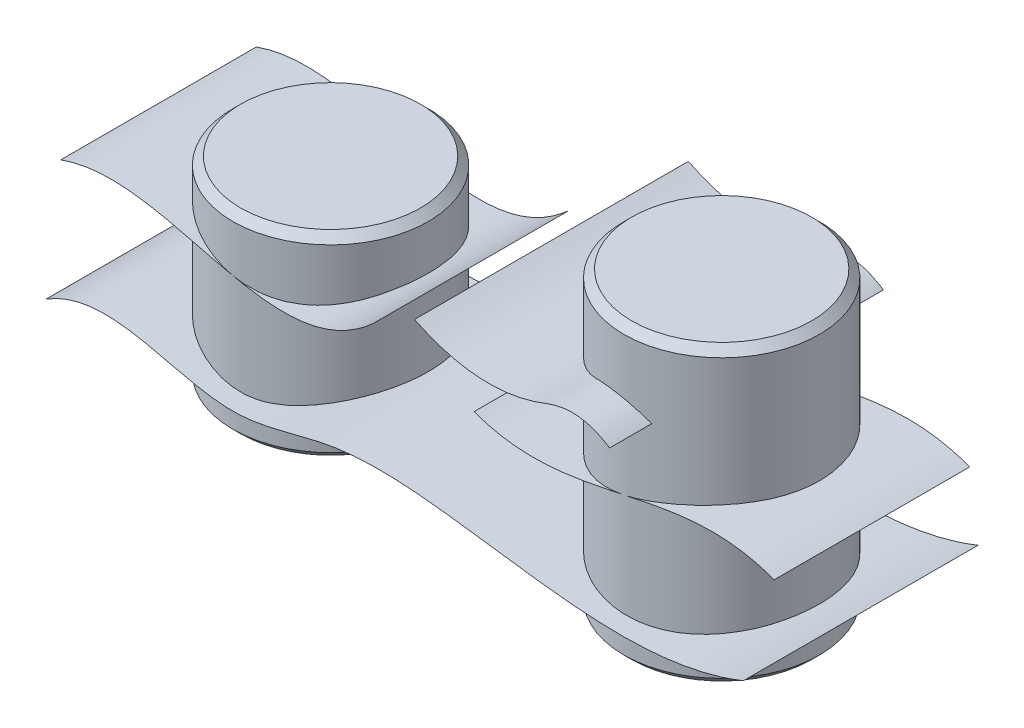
ISO-10303-21;
HEADER;
FILE_DESCRIPTION(('STEP AP214'),'2;1');
FILE_NAME('part.step','',(''),(''),'','','');
FILE_SCHEMA(('AUTOMOTIVE_DESIGN { 1 0 10303 214 1 1 1 1 }'));
ENDSEC;
DATA;
#1=APPLICATION_CONTEXT('core data for automotive mechanical design processes');
#2=APPLICATION_PROTOCOL_DEFINITION('international standard','automotive_design',2000,#1);
#3=PRODUCT_CONTEXT('',#1,'mechanical');
#4=PRODUCT('Part','Part','',(#3));
#5=PRODUCT_RELATED_PRODUCT_CATEGORY('part','',(#4));
#6=PRODUCT_DEFINITION_FORMATION('','',#4);
#7=PRODUCT_DEFINITION_CONTEXT('part definition',#1,'design');
#8=PRODUCT_DEFINITION('design','',#6,#7);
#9=PRODUCT_DEFINITION_SHAPE('','',#8);
#10=(LENGTH_UNIT() NAMED_UNIT(*) SI_UNIT(.MILLI.,.METRE.));
#11=(NAMED_UNIT(*) PLANE_ANGLE_UNIT() SI_UNIT($,.RADIAN.));
#12=(NAMED_UNIT(*) SI_UNIT($,.STERADIAN.) SOLID_ANGLE_UNIT());
#13=UNCERTAINTY_MEASURE_WITH_UNIT(LENGTH_MEASURE(1.E-05),#10,'distance_accuracy_value','');
#14=(GEOMETRIC_REPRESENTATION_CONTEXT(3) GLOBAL_UNCERTAINTY_ASSIGNED_CONTEXT((#13)) GLOBAL_UNIT_ASSIGNED_CONTEXT((#10,
#11,#12)) REPRESENTATION_CONTEXT('',''));
#15=CARTESIAN_POINT('',(0.,0.,0.));
#16=DIRECTION('',(0.,0.,1.));
#17=DIRECTION('',(1.,0.,0.));
#18=AXIS2_PLACEMENT_3D('',#15,#16,#17);
#19=CARTESIAN_POINT('',(61.6966040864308,36.7579614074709,-25.));
#20=CARTESIAN_POINT('',(87.2884607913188,27.2617068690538,-25.));
#21=CARTESIAN_POINT('',(112.376036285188,47.7539861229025,-25.));
#22=CARTESIAN_POINT('',(138.418377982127,37.8768206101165,-25.));
#23=B_SPLINE_CURVE_WITH_KNOTS('',3,(#19,#20,#21,#22),.UNSPECIFIED.,.F.,.F.,(4,4),(0.,1.),.UNSPECIFIED.);
#24=DIRECTION('',(0.,0.,1.));
#25=VECTOR('',#24,1.);
#26=SURFACE_OF_LINEAR_EXTRUSION('',#23,#25);
#27=CARTESIAN_POINT('',(61.6966040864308,36.7579614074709,25.));
#28=CARTESIAN_POINT('',(87.2884607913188,27.2617068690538,25.));
#29=CARTESIAN_POINT('',(112.376036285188,47.7539861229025,25.));
#30=CARTESIAN_POINT('',(138.418377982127,37.8768206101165,25.));
#31=B_SPLINE_CURVE_WITH_KNOTS('',3,(#27,#28,#29,#30),.UNSPECIFIED.,.F.,.F.,(4,4),(0.,1.),.UNSPECIFIED.);
#32=CARTESIAN_POINT('',(61.6966040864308,36.7579614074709,25.));
#33=VERTEX_POINT('',#32);
#34=CARTESIAN_POINT('',(138.418377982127,37.8768206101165,25.));
#35=VERTEX_POINT('',#34);
#36=EDGE_CURVE('E90',#33,#35,#31,.T.);
#37=ORIENTED_EDGE('',*,*,#36,.F.);
#38=DIRECTION('',(0.,0.,1.));
#39=VECTOR('',#38,1.);
#40=CARTESIAN_POINT('',(61.6966040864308,36.7579614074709,-25.));
#41=LINE('',#40,#39);
#42=CARTESIAN_POINT('',(61.6966040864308,36.7579614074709,-25.));
#43=VERTEX_POINT('',#42);
#44=EDGE_CURVE('E72',#43,#33,#41,.T.);
#45=ORIENTED_EDGE('',*,*,#44,.F.);
#46=CARTESIAN_POINT('',(138.418377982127,37.8768206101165,-25.));
#47=VERTEX_POINT('',#46);
#48=EDGE_CURVE('E78',#43,#47,#23,.T.);
#49=ORIENTED_EDGE('',*,*,#48,.T.);
#50=DIRECTION('',(0.,0.,1.));
#51=VECTOR('',#50,1.);
#52=CARTESIAN_POINT('',(138.418377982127,37.8768206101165,-25.));
#53=LINE('',#52,#51);
#54=EDGE_CURVE('E12',#47,#35,#53,.T.);
#55=ORIENTED_EDGE('',*,*,#54,.T.);
#56=EDGE_LOOP('',(#37,#45,#49,#55));
#57=FACE_BOUND('',#56,.T.);
#58=ADVANCED_FACE('F70',(#57),#26,.T.);
#59=OPEN_SHELL('',(#58));
#60=SHELL_BASED_SURFACE_MODEL('B2',(#59));
#61=CARTESIAN_POINT('',(-42.7703869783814,11.9283653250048,-30.));
#62=CARTESIAN_POINT('',(-26.5524549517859,22.1396582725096,-30.));
#63=CARTESIAN_POINT('',(-2.34276550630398,5.01295802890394,-30.));
#64=CARTESIAN_POINT('',(31.3648210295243,18.1425571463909,-30.));
#65=CARTESIAN_POINT('',(75.3815212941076,14.8600817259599,-30.));
#66=CARTESIAN_POINT('',(110.626128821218,6.61905902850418,-30.));
#67=CARTESIAN_POINT('',(135.539703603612,16.5890843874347,-30.));
#68=B_SPLINE_CURVE_WITH_KNOTS('',3,(#61,#62,#63,#64,#65,#66,#67),.UNSPECIFIED.,.F.,.F.,(4,1,1,1,
4),(0.,0.272917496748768,0.405708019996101,0.57686381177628,1.),.UNSPECIFIED.);
#69=DIRECTION('',(0.,0.,1.));
#70=VECTOR('',#69,1.);
#71=SURFACE_OF_LINEAR_EXTRUSION('',#68,#70);
#72=CARTESIAN_POINT('',(-42.7703869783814,11.9283653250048,30.));
#73=CARTESIAN_POINT('',(-26.5524549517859,22.1396582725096,30.));
#74=CARTESIAN_POINT('',(-2.34276550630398,5.01295802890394,30.));
#75=CARTESIAN_POINT('',(31.3648210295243,18.1425571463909,30.));
#76=CARTESIAN_POINT('',(75.3815212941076,14.8600817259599,30.));
#77=CARTESIAN_POINT('',(110.626128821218,6.61905902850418,30.));
#78=CARTESIAN_POINT('',(135.539703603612,16.5890843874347,30.));
#79=B_SPLINE_CURVE_WITH_KNOTS('',3,(#72,#73,#74,#75,#76,#77,#78),.UNSPECIFIED.,.F.,.F.,(4,1,1,1,
4),(0.,0.272917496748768,0.405708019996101,0.57686381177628,1.),.UNSPECIFIED.);
#80=CARTESIAN_POINT('',(-42.7703869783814,11.9283653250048,30.));
#81=VERTEX_POINT('',#80);
#82=CARTESIAN_POINT('',(135.539703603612,16.5890843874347,30.));
#83=VERTEX_POINT('',#82);
#84=EDGE_CURVE('E181',#81,#83,#79,.T.);
#85=ORIENTED_EDGE('',*,*,#84,.F.);
#86=DIRECTION('',(0.,0.,1.));
#87=VECTOR('',#86,1.);
#88=CARTESIAN_POINT('',(-42.7703869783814,11.9283653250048,-30.));
#89=LINE('',#88,#87);
#90=CARTESIAN_POINT('',(-42.7703869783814,11.9283653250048,-30.));
#91=VERTEX_POINT('',#90);
#92=EDGE_CURVE('E163',#91,#81,#89,.T.);
#93=ORIENTED_EDGE('',*,*,#92,.F.);
#94=CARTESIAN_POINT('',(135.539703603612,16.5890843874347,-30.));
#95=VERTEX_POINT('',#94);
#96=EDGE_CURVE('E169',#91,#95,#68,.T.);
#97=ORIENTED_EDGE('',*,*,#96,.T.);
#98=DIRECTION('',(0.,0.,1.));
#99=VECTOR('',#98,1.);
#100=CARTESIAN_POINT('',(135.539703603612,16.5890843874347,-30.));
#101=LINE('',#100,#99);
#102=EDGE_CURVE('E68',#95,#83,#101,.T.);
#103=ORIENTED_EDGE('',*,*,#102,.T.);
#104=EDGE_LOOP('',(#85,#93,#97,#103));
#105=FACE_BOUND('',#104,.T.);
#106=ADVANCED_FACE('F161',(#105),#71,.T.);
#107=OPEN_SHELL('',(#106));
#108=SHELL_BASED_SURFACE_MODEL('B6',(#107));
#109=CARTESIAN_POINT('',(56.4549559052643,59.5526966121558,-35.));
#110=CARTESIAN_POINT('',(73.5417833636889,51.1811602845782,-35.));
#111=CARTESIAN_POINT('',(98.6789530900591,61.1450510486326,-35.));
#112=CARTESIAN_POINT('',(106.335937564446,56.0257585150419,-35.));
#113=B_SPLINE_CURVE_WITH_KNOTS('',2,(#109,#110,#111,#112),.UNSPECIFIED.,.F.,.F.,(3,1,3),(0.,
0.663201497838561,1.),.UNSPECIFIED.);
#114=DIRECTION('',(0.,0.,1.));
#115=VECTOR('',#114,1.);
#116=SURFACE_OF_LINEAR_EXTRUSION('',#113,#115);
#117=CARTESIAN_POINT('',(56.4549559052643,59.5526966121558,35.));
#118=CARTESIAN_POINT('',(73.5417833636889,51.1811602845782,35.));
#119=CARTESIAN_POINT('',(98.6789530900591,61.1450510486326,35.));
#120=CARTESIAN_POINT('',(106.335937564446,56.0257585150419,35.));
#121=B_SPLINE_CURVE_WITH_KNOTS('',2,(#117,#118,#119,#120),.UNSPECIFIED.,.F.,.F.,(3,1,3),(0.,
0.663201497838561,1.),.UNSPECIFIED.);
#122=CARTESIAN_POINT('',(56.4549559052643,59.5526966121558,35.));
#123=VERTEX_POINT('',#122);
#124=CARTESIAN_POINT('',(106.335937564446,56.0257585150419,35.));
#125=VERTEX_POINT('',#124);
#126=EDGE_CURVE('E253',#123,#125,#121,.T.);
#127=ORIENTED_EDGE('',*,*,#126,.F.);
#128=DIRECTION('',(0.,0.,1.));
#129=VECTOR('',#128,1.);
#130=CARTESIAN_POINT('',(56.4549559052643,59.5526966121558,-35.));
#131=LINE('',#130,#129);
#132=CARTESIAN_POINT('',(56.4549559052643,59.5526966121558,-35.));
#133=VERTEX_POINT('',#132);
#134=EDGE_CURVE('E235',#133,#123,#131,.T.);
#135=ORIENTED_EDGE('',*,*,#134,.F.);
#136=CARTESIAN_POINT('',(106.335937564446,56.0257585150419,-35.));
#137=VERTEX_POINT('',#136);
#138=EDGE_CURVE('E241',#133,#137,#113,.T.);
#139=ORIENTED_EDGE('',*,*,#138,.T.);
#140=DIRECTION('',(0.,0.,1.));
#141=VECTOR('',#140,1.);
#142=CARTESIAN_POINT('',(106.335937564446,56.0257585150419,-35.));
#143=LINE('',#142,#141);
#144=EDGE_CURVE('E159',#137,#125,#143,.T.);
#145=ORIENTED_EDGE('',*,*,#144,.T.);
#146=EDGE_LOOP('',(#127,#135,#139,#145));
#147=FACE_BOUND('',#146,.T.);
#148=ADVANCED_FACE('F233',(#147),#116,.T.);
#149=OPEN_SHELL('',(#148));
#150=SHELL_BASED_SURFACE_MODEL('B62',(#149));
#151=CARTESIAN_POINT('',(-44.0004747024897,39.6610857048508,-25.));
#152=CARTESIAN_POINT('',(-16.5389436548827,49.648531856,-25.));
#153=CARTESIAN_POINT('',(10.8214156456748,20.5887983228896,-25.));
#154=CARTESIAN_POINT('',(35.9778547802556,43.4551241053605,-25.));
#155=B_SPLINE_CURVE_WITH_KNOTS('',3,(#151,#152,#153,#154),.UNSPECIFIED.,.F.,.F.,(4,4),(0.,1.),.UNSPECIFIED.);
#156=DIRECTION('',(0.,0.,1.));
#157=VECTOR('',#156,1.);
#158=SURFACE_OF_LINEAR_EXTRUSION('',#155,#157);
#159=CARTESIAN_POINT('',(-44.0004747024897,39.6610857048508,25.));
#160=CARTESIAN_POINT('',(-16.5389436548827,49.648531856,25.));
#161=CARTESIAN_POINT('',(10.8214156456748,20.5887983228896,25.));
#162=CARTESIAN_POINT('',(35.9778547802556,43.4551241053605,25.));
#163=B_SPLINE_CURVE_WITH_KNOTS('',3,(#159,#160,#161,#162),.UNSPECIFIED.,.F.,.F.,(4,4),(0.,1.),.UNSPECIFIED.);
#164=CARTESIAN_POINT('',(-44.0004747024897,39.6610857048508,25.));
#165=VERTEX_POINT('',#164);
#166=CARTESIAN_POINT('',(35.9778547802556,43.4551241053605,25.));
#167=VERTEX_POINT('',#166);
#168=EDGE_CURVE('E342',#165,#167,#163,.T.);
#169=ORIENTED_EDGE('',*,*,#168,.F.);
#170=DIRECTION('',(0.,0.,1.));
#171=VECTOR('',#170,1.);
#172=CARTESIAN_POINT('',(-44.0004747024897,39.6610857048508,-25.));
#173=LINE('',#172,#171);
#174=CARTESIAN_POINT('',(-44.0004747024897,39.6610857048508,-25.));
#175=VERTEX_POINT('',#174);
#176=EDGE_CURVE('E324',#175,#165,#173,.T.);
#177=ORIENTED_EDGE('',*,*,#176,.F.);
#178=CARTESIAN_POINT('',(35.9778547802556,43.4551241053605,-25.));
#179=VERTEX_POINT('',#178);
#180=EDGE_CURVE('E330',#175,#179,#155,.T.);
#181=ORIENTED_EDGE('',*,*,#180,.T.);
#182=DIRECTION('',(0.,0.,1.));
#183=VECTOR('',#182,1.);
#184=CARTESIAN_POINT('',(35.9778547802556,43.4551241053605,-25.));
#185=LINE('',#184,#183);
#186=EDGE_CURVE('E231',#179,#167,#185,.T.);
#187=ORIENTED_EDGE('',*,*,#186,.T.);
#188=EDGE_LOOP('',(#169,#177,#181,#187));
#189=FACE_BOUND('',#188,.T.);
#190=ADVANCED_FACE('F322',(#189),#158,.T.);
#191=OPEN_SHELL('',(#190));
#192=SHELL_BASED_SURFACE_MODEL('B153',(#191));
#193=CARTESIAN_POINT('',(100.,75.,0.));
#194=DIRECTION('',(0.,-1.,0.));
#195=DIRECTION('',(0.,0.,-1.));
#196=AXIS2_PLACEMENT_3D('',#193,#194,#195);
#197=CYLINDRICAL_SURFACE('',#196,25.);
#198=CARTESIAN_POINT('',(100.,2.,0.));
#199=DIRECTION('',(0.,1.,0.));
#200=DIRECTION('',(0.,0.,1.));
#201=AXIS2_PLACEMENT_3D('',#198,#199,#200);
#202=CIRCLE('',#201,25.);
#203=CARTESIAN_POINT('',(100.,2.,25.));
#204=VERTEX_POINT('',#203);
#205=EDGE_CURVE('E406',#204,#204,#202,.T.);
#206=ORIENTED_EDGE('',*,*,#205,.T.);
#207=EDGE_LOOP('',(#206));
#208=FACE_BOUND('',#207,.T.);
#209=CARTESIAN_POINT('',(100.,73.,0.));
#210=DIRECTION('',(0.,1.,0.));
#211=DIRECTION('',(0.,0.,1.));
#212=AXIS2_PLACEMENT_3D('',#209,#210,#211);
#213=CIRCLE('',#212,25.);
#214=CARTESIAN_POINT('',(100.,73.,25.));
#215=VERTEX_POINT('',#214);
#216=EDGE_CURVE('E413',#215,#215,#213,.F.);
#217=ORIENTED_EDGE('',*,*,#216,.T.);
#218=EDGE_LOOP('',(#217));
#219=FACE_BOUND('',#218,.T.);
#220=ADVANCED_FACE('F391',(#208,#219),#197,.T.);
#221=CARTESIAN_POINT('',(100.,75.,0.));
#222=DIRECTION('',(0.,1.,0.));
#223=DIRECTION('',(0.,0.,1.));
#224=AXIS2_PLACEMENT_3D('',#221,#222,#223);
#225=PLANE('',#224);
#226=CARTESIAN_POINT('',(100.,75.,0.));
#227=DIRECTION('',(0.,1.,0.));
#228=DIRECTION('',(0.,0.,1.));
#229=AXIS2_PLACEMENT_3D('',#226,#227,#228);
#230=CIRCLE('',#229,23.);
#231=CARTESIAN_POINT('',(100.,75.,23.));
#232=VERTEX_POINT('',#231);
#233=EDGE_CURVE('E321',#232,#232,#230,.T.);
#234=ORIENTED_EDGE('',*,*,#233,.T.);
#235=EDGE_LOOP('',(#234));
#236=FACE_BOUND('',#235,.T.);
#237=ADVANCED_FACE('F429',(#236),#225,.T.);
#238=CARTESIAN_POINT('',(100.,0.,0.));
#239=DIRECTION('',(0.,1.,0.));
#240=DIRECTION('',(0.,0.,1.));
#241=AXIS2_PLACEMENT_3D('',#238,#239,#240);
#242=PLANE('',#241);
#243=CARTESIAN_POINT('',(100.,0.,0.));
#244=DIRECTION('',(0.,1.,0.));
#245=DIRECTION('',(0.,0.,1.));
#246=AXIS2_PLACEMENT_3D('',#243,#244,#245);
#247=CIRCLE('',#246,23.);
#248=CARTESIAN_POINT('',(100.,0.,23.));
#249=VERTEX_POINT('',#248);
#250=EDGE_CURVE('E400',#249,#249,#247,.F.);
#251=ORIENTED_EDGE('',*,*,#250,.T.);
#252=EDGE_LOOP('',(#251));
#253=FACE_BOUND('',#252,.T.);
#254=ADVANCED_FACE('F426',(#253),#242,.F.);
#255=CARTESIAN_POINT('',(100.,2.,0.));
#256=DIRECTION('',(0.,1.,0.));
#257=DIRECTION('',(0.,0.,1.));
#258=AXIS2_PLACEMENT_3D('',#255,#256,#257);
#259=CONICAL_SURFACE('',#258,25.,0.785398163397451);
#260=ORIENTED_EDGE('',*,*,#250,.F.);
#261=EDGE_LOOP('',(#260));
#262=FACE_BOUND('',#261,.T.);
#263=ORIENTED_EDGE('',*,*,#205,.F.);
#264=EDGE_LOOP('',(#263));
#265=FACE_BOUND('',#264,.T.);
#266=ADVANCED_FACE('F423',(#262,#265),#259,.T.);
#267=CARTESIAN_POINT('',(100.,75.,0.));
#268=DIRECTION('',(0.,-1.,0.));
#269=DIRECTION('',(0.,0.,-1.));
#270=AXIS2_PLACEMENT_3D('',#267,#268,#269);
#271=CONICAL_SURFACE('',#270,23.,0.785398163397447);
#272=ORIENTED_EDGE('',*,*,#216,.F.);
#273=EDGE_LOOP('',(#272));
#274=FACE_BOUND('',#273,.T.);
#275=ORIENTED_EDGE('',*,*,#233,.F.);
#276=EDGE_LOOP('',(#275));
#277=FACE_BOUND('',#276,.T.);
#278=ADVANCED_FACE('F394',(#274,#277),#271,.T.);
#279=CLOSED_SHELL('',(#220,#237,#254,#266,#278));
#280=MANIFOLD_SOLID_BREP('B225',#279);
#281=CARTESIAN_POINT('',(0.,50.,0.));
#282=DIRECTION('',(0.,-1.,0.));
#283=DIRECTION('',(0.,0.,-1.));
#284=AXIS2_PLACEMENT_3D('',#281,#282,#283);
#285=CYLINDRICAL_SURFACE('',#284,25.);
#286=CARTESIAN_POINT('',(0.,1.99999999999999,0.));
#287=DIRECTION('',(0.,1.,0.));
#288=DIRECTION('',(0.,0.,1.));
#289=AXIS2_PLACEMENT_3D('',#286,#287,#288);
#290=CIRCLE('',#289,25.);
#291=CARTESIAN_POINT('',(0.,1.99999999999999,25.));
#292=VERTEX_POINT('',#291);
#293=EDGE_CURVE('E496',#292,#292,#290,.T.);
#294=ORIENTED_EDGE('',*,*,#293,.T.);
#295=EDGE_LOOP('',(#294));
#296=FACE_BOUND('',#295,.T.);
#297=CARTESIAN_POINT('',(0.,48.,0.));
#298=DIRECTION('',(0.,1.,0.));
#299=DIRECTION('',(0.,0.,1.));
#300=AXIS2_PLACEMENT_3D('',#297,#298,#299);
#301=CIRCLE('',#300,25.);
#302=CARTESIAN_POINT('',(0.,48.,25.));
#303=VERTEX_POINT('',#302);
#304=EDGE_CURVE('E500',#303,#303,#301,.F.);
#305=ORIENTED_EDGE('',*,*,#304,.T.);
#306=EDGE_LOOP('',(#305));
#307=FACE_BOUND('',#306,.T.);
#308=ADVANCED_FACE('F481',(#296,#307),#285,.T.);
#309=CARTESIAN_POINT('',(0.,50.,0.));
#310=DIRECTION('',(0.,1.,0.));
#311=DIRECTION('',(0.,0.,1.));
#312=AXIS2_PLACEMENT_3D('',#309,#310,#311);
#313=PLANE('',#312);
#314=CARTESIAN_POINT('',(0.,50.,0.));
#315=DIRECTION('',(0.,1.,0.));
#316=DIRECTION('',(0.,0.,1.));
#317=AXIS2_PLACEMENT_3D('',#314,#315,#316);
#318=CIRCLE('',#317,23.);
#319=CARTESIAN_POINT('',(0.,50.,23.));
#320=VERTEX_POINT('',#319);
#321=EDGE_CURVE('E390',#320,#320,#318,.T.);
#322=ORIENTED_EDGE('',*,*,#321,.T.);
#323=EDGE_LOOP('',(#322));
#324=FACE_BOUND('',#323,.T.);
#325=ADVANCED_FACE('F516',(#324),#313,.T.);
#326=CARTESIAN_POINT('',(0.,0.,0.));
#327=DIRECTION('',(0.,1.,0.));
#328=DIRECTION('',(0.,0.,1.));
#329=AXIS2_PLACEMENT_3D('',#326,#327,#328);
#330=PLANE('',#329);
#331=CARTESIAN_POINT('',(0.,0.,0.));
#332=DIRECTION('',(0.,1.,0.));
#333=DIRECTION('',(0.,0.,1.));
#334=AXIS2_PLACEMENT_3D('',#331,#332,#333);
#335=CIRCLE('',#334,23.);
#336=CARTESIAN_POINT('',(0.,0.,23.));
#337=VERTEX_POINT('',#336);
#338=EDGE_CURVE('E490',#337,#337,#335,.F.);
#339=ORIENTED_EDGE('',*,*,#338,.T.);
#340=EDGE_LOOP('',(#339));
#341=FACE_BOUND('',#340,.T.);
#342=ADVANCED_FACE('F513',(#341),#330,.F.);
#343=CARTESIAN_POINT('',(0.,1.99999999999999,0.));
#344=DIRECTION('',(0.,1.,0.));
#345=DIRECTION('',(0.,0.,1.));
#346=AXIS2_PLACEMENT_3D('',#343,#344,#345);
#347=CONICAL_SURFACE('',#346,25.,0.785398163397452);
#348=ORIENTED_EDGE('',*,*,#338,.F.);
#349=EDGE_LOOP('',(#348));
#350=FACE_BOUND('',#349,.T.);
#351=ORIENTED_EDGE('',*,*,#293,.F.);
#352=EDGE_LOOP('',(#351));
#353=FACE_BOUND('',#352,.T.);
#354=ADVANCED_FACE('F510',(#350,#353),#347,.T.);
#355=CARTESIAN_POINT('',(0.,50.,0.));
#356=DIRECTION('',(0.,-1.,0.));
#357=DIRECTION('',(0.,0.,-1.));
#358=AXIS2_PLACEMENT_3D('',#355,#356,#357);
#359=CONICAL_SURFACE('',#358,23.,0.785398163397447);
#360=ORIENTED_EDGE('',*,*,#304,.F.);
#361=EDGE_LOOP('',(#360));
#362=FACE_BOUND('',#361,.T.);
#363=ORIENTED_EDGE('',*,*,#321,.F.);
#364=EDGE_LOOP('',(#363));
#365=FACE_BOUND('',#364,.T.);
#366=ADVANCED_FACE('F484',(#362,#365),#359,.T.);
#367=CLOSED_SHELL('',(#308,#325,#342,#354,#366));
#368=MANIFOLD_SOLID_BREP('B316',#367);
#369=ADVANCED_BREP_SHAPE_REPRESENTATION('',(#18,#280,#368),#14);
#370=MANIFOLD_SURFACE_SHAPE_REPRESENTATION('',(#18,#60,#108,#150,#192),#14);
#371=SHAPE_REPRESENTATION('',(#18),#14);
#372=SHAPE_DEFINITION_REPRESENTATION(#9,#371);
#373=SHAPE_REPRESENTATION_RELATIONSHIP('','',#371,#369);
#374=SHAPE_REPRESENTATION_RELATIONSHIP('','',#371,#370);
ENDSEC;
END-ISO-10303-21;
